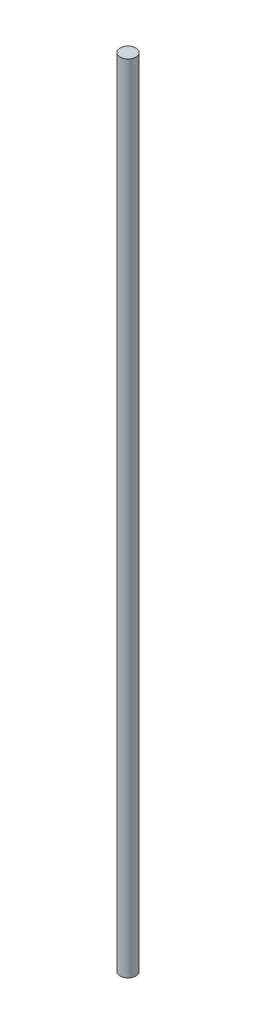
ISO-10303-21;
HEADER;
FILE_DESCRIPTION(('STEP AP214'),'2;1');
FILE_NAME('part.step','',(''),(''),'','','');
FILE_SCHEMA(('AUTOMOTIVE_DESIGN { 1 0 10303 214 1 1 1 1 }'));
ENDSEC;
DATA;
#1=APPLICATION_CONTEXT('core data for automotive mechanical design processes');
#2=APPLICATION_PROTOCOL_DEFINITION('international standard','automotive_design',2000,#1);
#3=PRODUCT_CONTEXT('',#1,'mechanical');
#4=PRODUCT('Part','Part','',(#3));
#5=PRODUCT_RELATED_PRODUCT_CATEGORY('part','',(#4));
#6=PRODUCT_DEFINITION_FORMATION('','',#4);
#7=PRODUCT_DEFINITION_CONTEXT('part definition',#1,'design');
#8=PRODUCT_DEFINITION('design','',#6,#7);
#9=PRODUCT_DEFINITION_SHAPE('','',#8);
#10=(LENGTH_UNIT() NAMED_UNIT(*) SI_UNIT(.MILLI.,.METRE.));
#11=(NAMED_UNIT(*) PLANE_ANGLE_UNIT() SI_UNIT($,.RADIAN.));
#12=(NAMED_UNIT(*) SI_UNIT($,.STERADIAN.) SOLID_ANGLE_UNIT());
#13=UNCERTAINTY_MEASURE_WITH_UNIT(LENGTH_MEASURE(1.E-05),#10,'distance_accuracy_value','');
#14=(GEOMETRIC_REPRESENTATION_CONTEXT(3) GLOBAL_UNCERTAINTY_ASSIGNED_CONTEXT((#13)) GLOBAL_UNIT_ASSIGNED_CONTEXT((#10,
#11,#12)) REPRESENTATION_CONTEXT('',''));
#15=CARTESIAN_POINT('',(0.,0.,0.));
#16=DIRECTION('',(0.,0.,1.));
#17=DIRECTION('',(1.,0.,0.));
#18=AXIS2_PLACEMENT_3D('',#15,#16,#17);
#19=CARTESIAN_POINT('',(0.,317.5,0.));
#20=DIRECTION('',(0.,-1.,0.));
#21=DIRECTION('',(0.,0.,-1.));
#22=AXIS2_PLACEMENT_3D('',#19,#20,#21);
#23=CYLINDRICAL_SURFACE('',#22,3.175);
#24=CARTESIAN_POINT('',(0.,317.5,0.));
#25=DIRECTION('',(0.,1.,0.));
#26=DIRECTION('',(0.,0.,1.));
#27=AXIS2_PLACEMENT_3D('',#24,#25,#26);
#28=CIRCLE('',#27,3.175);
#29=CARTESIAN_POINT('',(0.,317.5,-3.175));
#30=VERTEX_POINT('',#29);
#31=EDGE_CURVE('E10',#30,#30,#28,.T.);
#32=CARTESIAN_POINT('',(0.,0.,0.));
#33=DIRECTION('',(0.,1.,0.));
#34=DIRECTION('',(0.,0.,1.));
#35=AXIS2_PLACEMENT_3D('',#32,#33,#34);
#36=CIRCLE('',#35,3.175);
#37=CARTESIAN_POINT('',(0.,0.,-3.175));
#38=VERTEX_POINT('',#37);
#39=EDGE_CURVE('E34',#38,#38,#36,.T.);
#40=CARTESIAN_POINT('',(0.,317.5,-3.175));
#41=CARTESIAN_POINT('',(0.,314.192708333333,-3.175));
#42=CARTESIAN_POINT('',(0.,310.885416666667,-3.175));
#43=CARTESIAN_POINT('',(0.,304.270833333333,-3.175));
#44=CARTESIAN_POINT('',(0.,300.963541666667,-3.175));
#45=CARTESIAN_POINT('',(0.,294.348958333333,-3.175));
#46=CARTESIAN_POINT('',(0.,291.041666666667,-3.175));
#47=CARTESIAN_POINT('',(0.,284.427083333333,-3.175));
#48=CARTESIAN_POINT('',(0.,281.119791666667,-3.175));
#49=CARTESIAN_POINT('',(0.,274.505208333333,-3.175));
#50=CARTESIAN_POINT('',(0.,271.197916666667,-3.175));
#51=CARTESIAN_POINT('',(0.,264.583333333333,-3.175));
#52=CARTESIAN_POINT('',(0.,261.276041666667,-3.175));
#53=CARTESIAN_POINT('',(0.,254.661458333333,-3.175));
#54=CARTESIAN_POINT('',(0.,251.354166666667,-3.175));
#55=CARTESIAN_POINT('',(0.,244.739583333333,-3.175));
#56=CARTESIAN_POINT('',(0.,241.432291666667,-3.175));
#57=CARTESIAN_POINT('',(0.,234.817708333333,-3.175));
#58=CARTESIAN_POINT('',(0.,231.510416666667,-3.175));
#59=CARTESIAN_POINT('',(0.,224.895833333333,-3.175));
#60=CARTESIAN_POINT('',(0.,221.588541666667,-3.175));
#61=CARTESIAN_POINT('',(0.,214.973958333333,-3.175));
#62=CARTESIAN_POINT('',(0.,211.666666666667,-3.175));
#63=CARTESIAN_POINT('',(0.,205.052083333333,-3.175));
#64=CARTESIAN_POINT('',(0.,201.744791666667,-3.175));
#65=CARTESIAN_POINT('',(0.,195.130208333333,-3.175));
#66=CARTESIAN_POINT('',(0.,191.822916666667,-3.175));
#67=CARTESIAN_POINT('',(0.,185.208333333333,-3.175));
#68=CARTESIAN_POINT('',(0.,181.901041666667,-3.175));
#69=CARTESIAN_POINT('',(0.,175.286458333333,-3.175));
#70=CARTESIAN_POINT('',(0.,171.979166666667,-3.175));
#71=CARTESIAN_POINT('',(0.,165.364583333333,-3.175));
#72=CARTESIAN_POINT('',(0.,162.057291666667,-3.175));
#73=CARTESIAN_POINT('',(0.,155.442708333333,-3.175));
#74=CARTESIAN_POINT('',(0.,152.135416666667,-3.175));
#75=CARTESIAN_POINT('',(0.,145.520833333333,-3.175));
#76=CARTESIAN_POINT('',(0.,142.213541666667,-3.175));
#77=CARTESIAN_POINT('',(0.,135.598958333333,-3.175));
#78=CARTESIAN_POINT('',(0.,132.291666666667,-3.175));
#79=CARTESIAN_POINT('',(0.,125.677083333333,-3.175));
#80=CARTESIAN_POINT('',(0.,122.369791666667,-3.175));
#81=CARTESIAN_POINT('',(0.,115.755208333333,-3.175));
#82=CARTESIAN_POINT('',(0.,112.447916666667,-3.175));
#83=CARTESIAN_POINT('',(0.,105.833333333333,-3.175));
#84=CARTESIAN_POINT('',(0.,102.526041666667,-3.175));
#85=CARTESIAN_POINT('',(0.,95.9114583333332,-3.175));
#86=CARTESIAN_POINT('',(0.,92.6041666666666,-3.175));
#87=CARTESIAN_POINT('',(0.,85.9895833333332,-3.175));
#88=CARTESIAN_POINT('',(0.,82.6822916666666,-3.175));
#89=CARTESIAN_POINT('',(0.,76.0677083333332,-3.175));
#90=CARTESIAN_POINT('',(0.,72.7604166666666,-3.175));
#91=CARTESIAN_POINT('',(0.,66.1458333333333,-3.175));
#92=CARTESIAN_POINT('',(0.,62.8385416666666,-3.175));
#93=CARTESIAN_POINT('',(0.,56.2239583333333,-3.175));
#94=CARTESIAN_POINT('',(0.,52.9166666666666,-3.175));
#95=CARTESIAN_POINT('',(0.,46.3020833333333,-3.175));
#96=CARTESIAN_POINT('',(0.,42.9947916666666,-3.175));
#97=CARTESIAN_POINT('',(0.,36.3802083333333,-3.175));
#98=CARTESIAN_POINT('',(0.,33.0729166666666,-3.175));
#99=CARTESIAN_POINT('',(0.,26.4583333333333,-3.175));
#100=CARTESIAN_POINT('',(0.,23.1510416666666,-3.175));
#101=CARTESIAN_POINT('',(0.,16.5364583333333,-3.175));
#102=CARTESIAN_POINT('',(0.,13.2291666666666,-3.175));
#103=CARTESIAN_POINT('',(0.,6.61458333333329,-3.175));
#104=CARTESIAN_POINT('',(0.,3.30729166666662,-3.175));
#105=CARTESIAN_POINT('',(0.,0.,-3.175));
#106=B_SPLINE_CURVE_WITH_KNOTS('',3,(#40,#41,#42,#43,#44,#45,#46,#47,#48,#49,#50,#51,#52,#53,
#54,#55,#56,#57,#58,#59,#60,#61,#62,#63,#64,#65,#66,#67,#68,#69,#70,#71,#72,#73,#74,#75,#76,#77,
#78,#79,#80,#81,#82,#83,#84,#85,#86,#87,#88,#89,#90,#91,#92,#93,#94,#95,#96,#97,#98,#99,#100,
#101,#102,#103,#104,#105),.UNSPECIFIED.,.F.,.F.,(4,2,2,2,2,2,2,2,2,2,2,2,2,2,2,2,2,2,2,2,2,2,2,
2,2,2,2,2,2,2,2,2,4),(0.,9.92187500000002,19.84375,29.765625,39.6875,49.6093750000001,59.53125,
69.4531250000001,79.375,89.2968750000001,99.2187500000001,109.140625,119.0625,128.984375,
138.90625,148.828125,158.75,168.671875,178.59375,188.515625,198.4375,208.359375,218.28125,
228.203125,238.125,248.046875,257.96875,267.890625,277.8125,287.734375,297.65625,307.578125,
317.5),.UNSPECIFIED.);
#107=EDGE_CURVE('BSEAM31',#30,#38,#106,.T.);
#108=ORIENTED_EDGE('',*,*,#31,.F.);
#109=ORIENTED_EDGE('',*,*,#39,.T.);
#110=ORIENTED_EDGE('',*,*,#107,.T.);
#111=ORIENTED_EDGE('',*,*,#107,.F.);
#112=EDGE_LOOP('',(#108,#110,#109,#111));
#113=FACE_BOUND('',#112,.T.);
#114=ADVANCED_FACE('F31',(#113),#23,.T.);
#115=CARTESIAN_POINT('',(0.,317.5,0.));
#116=DIRECTION('',(0.,1.,0.));
#117=DIRECTION('',(0.,0.,1.));
#118=AXIS2_PLACEMENT_3D('',#115,#116,#117);
#119=PLANE('',#118);
#120=ORIENTED_EDGE('',*,*,#31,.T.);
#121=EDGE_LOOP('',(#120));
#122=FACE_BOUND('',#121,.T.);
#123=ADVANCED_FACE('F46',(#122),#119,.T.);
#124=CARTESIAN_POINT('',(0.,0.,0.));
#125=DIRECTION('',(0.,1.,0.));
#126=DIRECTION('',(0.,0.,1.));
#127=AXIS2_PLACEMENT_3D('',#124,#125,#126);
#128=PLANE('',#127);
#129=ORIENTED_EDGE('',*,*,#39,.F.);
#130=EDGE_LOOP('',(#129));
#131=FACE_BOUND('',#130,.T.);
#132=ADVANCED_FACE('F44',(#131),#128,.F.);
#133=CLOSED_SHELL('',(#114,#123,#132));
#134=MANIFOLD_SOLID_BREP('B2',#133);
#135=ADVANCED_BREP_SHAPE_REPRESENTATION('',(#18,#134),#14);
#136=SHAPE_DEFINITION_REPRESENTATION(#9,#135);
ENDSEC;
END-ISO-10303-21;
